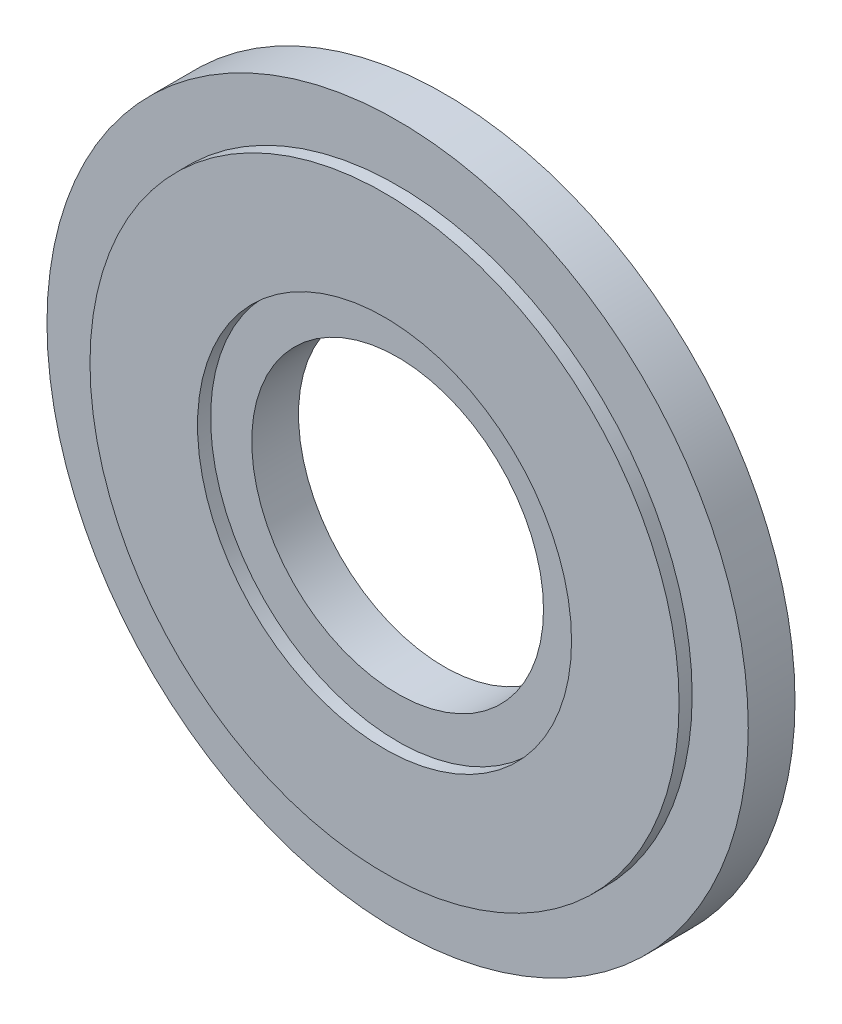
from build123d import *

# Parameters (mm, degrees)
SKETCH1_R                   = 9.525
SKETCH1_R_2                 = 3.9624
BASE_EXTRUDE_DEPTH          = 1.27
NEEDLE_FOOTPRINT_DEPTH      = 0.3556
NEEDLE_FOOTPRINT_DEPTH_BACK = 1.6256
SKETCH2_R                   = 8.001
SKETCH2_R_2                 = 5.08


with BuildPart() as part:
    # Sketch1 → Base-Extrude (new body)
    with BuildSketch(Plane.XY):
        Circle(SKETCH1_R)
        Circle(SKETCH1_R_2, mode=Mode.SUBTRACT)
    extrude(amount=-BASE_EXTRUDE_DEPTH)

    # Sketch2 → needle_footprint (add, two sides: drawn at the far end of the back side and taken through both)
    with BuildSketch(Plane.XY.offset(-NEEDLE_FOOTPRINT_DEPTH_BACK)):
        Circle(SKETCH2_R)
        Circle(SKETCH2_R_2, mode=Mode.SUBTRACT)
    extrude(amount=NEEDLE_FOOTPRINT_DEPTH + NEEDLE_FOOTPRINT_DEPTH_BACK)


solid = part.part
